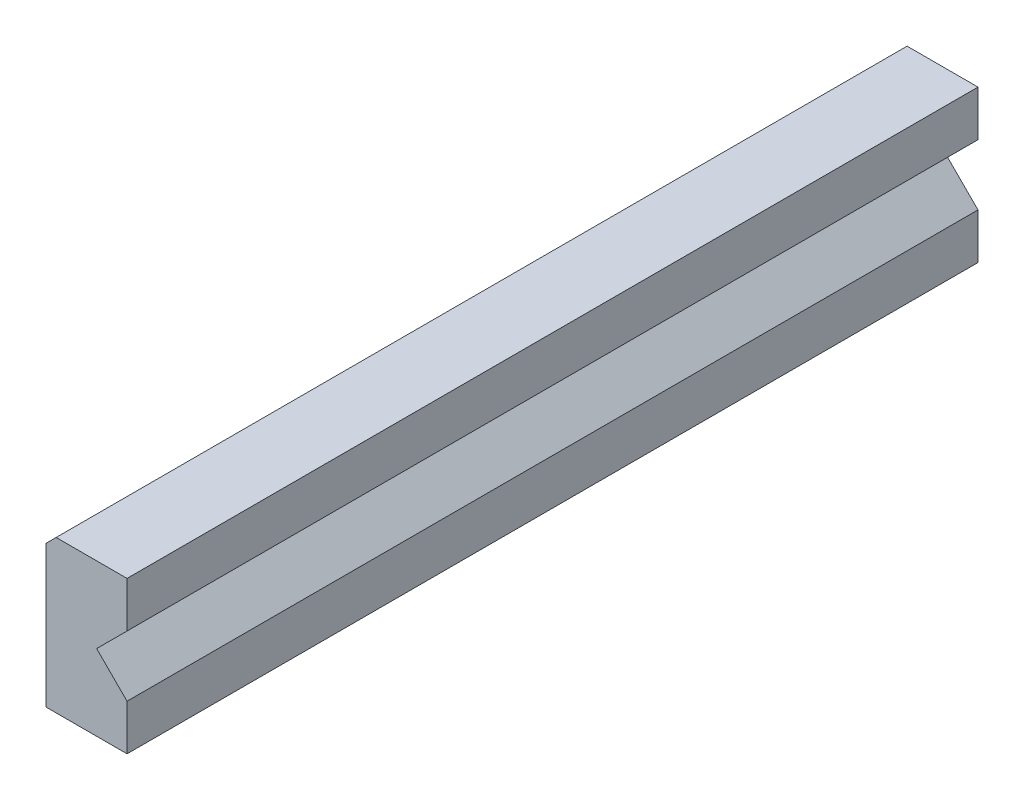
from build123d import *

# Parameters (mm, degrees)
ESQUISSE1_W             = 4
ESQUISSE1_H             = 7.5
BASE_EXTRUSION_DEPTH    = 42
ENL_V_MAT_EXTRU_4_DEPTH = 43.851487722
CHANFREIN2_SIZE         = 0.5


with BuildPart() as part:
    # Esquisse1 → Base-Extrusion (new body)
    with BuildSketch(Plane.XY):
        with Locations((2, 3.75)):
            Rectangle(ESQUISSE1_W, ESQUISSE1_H)
    extrude(amount=-BASE_EXTRUSION_DEPTH)

    # Esquisse5 → Enl_v. mat.-Extru.4 (cut, through all)
    with BuildSketch(Plane.XY):
        Polygon((2.5, 3.75), (4.21021234, 5.46021234), (4.266268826, 1.983731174), align=None)
    extrude(amount=-ENL_V_MAT_EXTRU_4_DEPTH, mode=Mode.SUBTRACT)

    # Chanfrein2
    chanfrein2_edges = [part.edges().sort_by_distance(p)[0] for p in [
        (0, 7.5, -21),
    ]]
    chamfer(chanfrein2_edges, length=CHANFREIN2_SIZE)


solid = part.part
